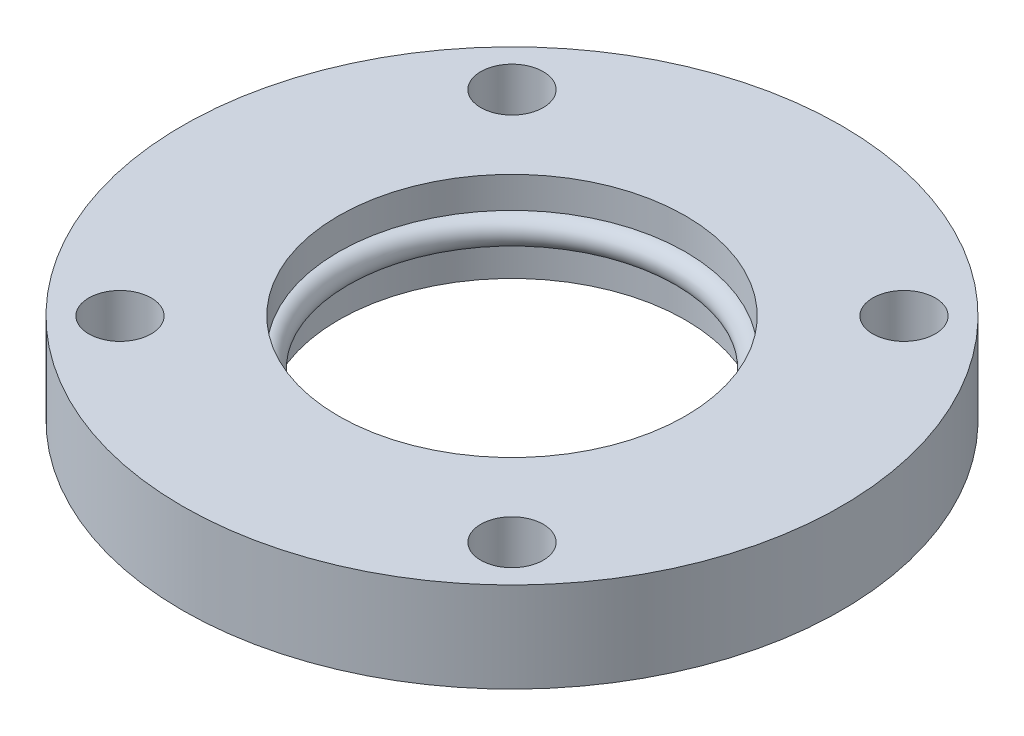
ISO-10303-21;
HEADER;
FILE_DESCRIPTION(('STEP AP214'),'2;1');
FILE_NAME('part.step','',(''),(''),'','','');
FILE_SCHEMA(('AUTOMOTIVE_DESIGN { 1 0 10303 214 1 1 1 1 }'));
ENDSEC;
DATA;
#1=APPLICATION_CONTEXT('core data for automotive mechanical design processes');
#2=APPLICATION_PROTOCOL_DEFINITION('international standard','automotive_design',2000,#1);
#3=PRODUCT_CONTEXT('',#1,'mechanical');
#4=PRODUCT('Part','Part','',(#3));
#5=PRODUCT_RELATED_PRODUCT_CATEGORY('part','',(#4));
#6=PRODUCT_DEFINITION_FORMATION('','',#4);
#7=PRODUCT_DEFINITION_CONTEXT('part definition',#1,'design');
#8=PRODUCT_DEFINITION('design','',#6,#7);
#9=PRODUCT_DEFINITION_SHAPE('','',#8);
#10=(LENGTH_UNIT() NAMED_UNIT(*) SI_UNIT(.MILLI.,.METRE.));
#11=(NAMED_UNIT(*) PLANE_ANGLE_UNIT() SI_UNIT($,.RADIAN.));
#12=(NAMED_UNIT(*) SI_UNIT($,.STERADIAN.) SOLID_ANGLE_UNIT());
#13=UNCERTAINTY_MEASURE_WITH_UNIT(LENGTH_MEASURE(1.E-05),#10,'distance_accuracy_value','');
#14=(GEOMETRIC_REPRESENTATION_CONTEXT(3) GLOBAL_UNCERTAINTY_ASSIGNED_CONTEXT((#13)) GLOBAL_UNIT_ASSIGNED_CONTEXT((#10,
#11,#12)) REPRESENTATION_CONTEXT('',''));
#15=CARTESIAN_POINT('',(0.,0.,0.));
#16=DIRECTION('',(0.,0.,1.));
#17=DIRECTION('',(1.,0.,0.));
#18=AXIS2_PLACEMENT_3D('',#15,#16,#17);
#19=CARTESIAN_POINT('',(0.,6.5,0.));
#20=DIRECTION('',(0.,-1.,0.));
#21=DIRECTION('',(0.,0.,-1.));
#22=AXIS2_PLACEMENT_3D('',#19,#20,#21);
#23=CYLINDRICAL_SURFACE('',#22,25.);
#24=CARTESIAN_POINT('',(0.,-6.5,0.));
#25=DIRECTION('',(0.,1.,0.));
#26=DIRECTION('',(0.,0.,1.));
#27=AXIS2_PLACEMENT_3D('',#24,#25,#26);
#28=CIRCLE('',#27,25.);
#29=CARTESIAN_POINT('',(0.,-6.5,-25.));
#30=VERTEX_POINT('',#29);
#31=EDGE_CURVE('E49',#30,#30,#28,.T.);
#32=CARTESIAN_POINT('',(0.,-2.,0.));
#33=DIRECTION('',(0.,1.,0.));
#34=DIRECTION('',(0.,0.,1.));
#35=AXIS2_PLACEMENT_3D('',#32,#33,#34);
#36=CIRCLE('',#35,25.);
#37=CARTESIAN_POINT('',(0.,-2.,-25.));
#38=VERTEX_POINT('',#37);
#39=EDGE_CURVE('E37',#38,#38,#36,.T.);
#40=CARTESIAN_POINT('',(0.,-6.5,-25.));
#41=CARTESIAN_POINT('',(0.,-6.453125,-25.));
#42=CARTESIAN_POINT('',(0.,-6.40625,-25.));
#43=CARTESIAN_POINT('',(0.,-6.3125,-25.));
#44=CARTESIAN_POINT('',(0.,-6.265625,-25.));
#45=CARTESIAN_POINT('',(0.,-6.171875,-25.));
#46=CARTESIAN_POINT('',(0.,-6.125,-25.));
#47=CARTESIAN_POINT('',(0.,-6.03125,-25.));
#48=CARTESIAN_POINT('',(0.,-5.984375,-25.));
#49=CARTESIAN_POINT('',(0.,-5.890625,-25.));
#50=CARTESIAN_POINT('',(0.,-5.84375,-25.));
#51=CARTESIAN_POINT('',(0.,-5.75,-25.));
#52=CARTESIAN_POINT('',(0.,-5.703125,-25.));
#53=CARTESIAN_POINT('',(0.,-5.609375,-25.));
#54=CARTESIAN_POINT('',(0.,-5.5625,-25.));
#55=CARTESIAN_POINT('',(0.,-5.46875,-25.));
#56=CARTESIAN_POINT('',(0.,-5.421875,-25.));
#57=CARTESIAN_POINT('',(0.,-5.328125,-25.));
#58=CARTESIAN_POINT('',(0.,-5.28125,-25.));
#59=CARTESIAN_POINT('',(0.,-5.1875,-25.));
#60=CARTESIAN_POINT('',(0.,-5.140625,-25.));
#61=CARTESIAN_POINT('',(0.,-5.046875,-25.));
#62=CARTESIAN_POINT('',(0.,-5.,-25.));
#63=CARTESIAN_POINT('',(0.,-4.90625,-25.));
#64=CARTESIAN_POINT('',(0.,-4.859375,-25.));
#65=CARTESIAN_POINT('',(0.,-4.765625,-25.));
#66=CARTESIAN_POINT('',(0.,-4.71875,-25.));
#67=CARTESIAN_POINT('',(0.,-4.625,-25.));
#68=CARTESIAN_POINT('',(0.,-4.578125,-25.));
#69=CARTESIAN_POINT('',(0.,-4.484375,-25.));
#70=CARTESIAN_POINT('',(0.,-4.4375,-25.));
#71=CARTESIAN_POINT('',(0.,-4.34375,-25.));
#72=CARTESIAN_POINT('',(0.,-4.296875,-25.));
#73=CARTESIAN_POINT('',(0.,-4.203125,-25.));
#74=CARTESIAN_POINT('',(0.,-4.15625,-25.));
#75=CARTESIAN_POINT('',(0.,-4.0625,-25.));
#76=CARTESIAN_POINT('',(0.,-4.015625,-25.));
#77=CARTESIAN_POINT('',(0.,-3.921875,-25.));
#78=CARTESIAN_POINT('',(0.,-3.875,-25.));
#79=CARTESIAN_POINT('',(0.,-3.78125,-25.));
#80=CARTESIAN_POINT('',(0.,-3.734375,-25.));
#81=CARTESIAN_POINT('',(0.,-3.640625,-25.));
#82=CARTESIAN_POINT('',(0.,-3.59375,-25.));
#83=CARTESIAN_POINT('',(0.,-3.5,-25.));
#84=CARTESIAN_POINT('',(0.,-3.453125,-25.));
#85=CARTESIAN_POINT('',(0.,-3.359375,-25.));
#86=CARTESIAN_POINT('',(0.,-3.3125,-25.));
#87=CARTESIAN_POINT('',(0.,-3.21875,-25.));
#88=CARTESIAN_POINT('',(0.,-3.171875,-25.));
#89=CARTESIAN_POINT('',(0.,-3.078125,-25.));
#90=CARTESIAN_POINT('',(0.,-3.03125,-25.));
#91=CARTESIAN_POINT('',(0.,-2.9375,-25.));
#92=CARTESIAN_POINT('',(0.,-2.890625,-25.));
#93=CARTESIAN_POINT('',(0.,-2.796875,-25.));
#94=CARTESIAN_POINT('',(0.,-2.75,-25.));
#95=CARTESIAN_POINT('',(0.,-2.65625,-25.));
#96=CARTESIAN_POINT('',(0.,-2.609375,-25.));
#97=CARTESIAN_POINT('',(0.,-2.515625,-25.));
#98=CARTESIAN_POINT('',(0.,-2.46875,-25.));
#99=CARTESIAN_POINT('',(0.,-2.375,-25.));
#100=CARTESIAN_POINT('',(0.,-2.328125,-25.));
#101=CARTESIAN_POINT('',(0.,-2.234375,-25.));
#102=CARTESIAN_POINT('',(0.,-2.1875,-25.));
#103=CARTESIAN_POINT('',(0.,-2.09375,-25.));
#104=CARTESIAN_POINT('',(0.,-2.046875,-25.));
#105=CARTESIAN_POINT('',(0.,-2.,-25.));
#106=B_SPLINE_CURVE_WITH_KNOTS('',3,(#40,#41,#42,#43,#44,#45,#46,#47,#48,#49,#50,#51,#52,#53,
#54,#55,#56,#57,#58,#59,#60,#61,#62,#63,#64,#65,#66,#67,#68,#69,#70,#71,#72,#73,#74,#75,#76,#77,
#78,#79,#80,#81,#82,#83,#84,#85,#86,#87,#88,#89,#90,#91,#92,#93,#94,#95,#96,#97,#98,#99,#100,
#101,#102,#103,#104,#105),.UNSPECIFIED.,.F.,.F.,(4,2,2,2,2,2,2,2,2,2,2,2,2,2,2,2,2,2,2,2,2,2,2,
2,2,2,2,2,2,2,2,2,4),(0.,0.140625,0.28125,0.421875,0.5625,0.703124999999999,0.843749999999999,
0.984374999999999,1.125,1.265625,1.40625,1.546875,1.6875,1.828125,1.96875,2.109375,2.25,
2.390625,2.53125,2.671875,2.8125,2.953125,3.09375,3.234375,3.375,3.515625,3.65625,3.796875,
3.9375,4.078125,4.21875,4.359375,4.5),.UNSPECIFIED.);
#107=EDGE_CURVE('BSEAM33',#30,#38,#106,.T.);
#108=ORIENTED_EDGE('',*,*,#31,.F.);
#109=ORIENTED_EDGE('',*,*,#39,.T.);
#110=ORIENTED_EDGE('',*,*,#107,.T.);
#111=ORIENTED_EDGE('',*,*,#107,.F.);
#112=EDGE_LOOP('',(#108,#110,#109,#111));
#113=FACE_BOUND('',#112,.T.);
#114=ADVANCED_FACE('F33',(#113),#23,.F.);
#115=CARTESIAN_POINT('',(0.,6.5,0.));
#116=DIRECTION('',(0.,1.,0.));
#117=DIRECTION('',(0.,0.,1.));
#118=AXIS2_PLACEMENT_3D('',#115,#116,#117);
#119=CIRCLE('',#118,25.);
#120=CARTESIAN_POINT('',(0.,6.5,-25.));
#121=VERTEX_POINT('',#120);
#122=EDGE_CURVE('E46',#121,#121,#119,.T.);
#123=CARTESIAN_POINT('',(0.,2.,0.));
#124=DIRECTION('',(0.,-1.,0.));
#125=DIRECTION('',(0.,0.,-1.));
#126=AXIS2_PLACEMENT_3D('',#123,#124,#125);
#127=CIRCLE('',#126,25.);
#128=CARTESIAN_POINT('',(0.,2.,-25.));
#129=VERTEX_POINT('',#128);
#130=EDGE_CURVE('E51',#129,#129,#127,.T.);
#131=CARTESIAN_POINT('',(0.,6.5,-25.));
#132=CARTESIAN_POINT('',(0.,6.453125,-25.));
#133=CARTESIAN_POINT('',(0.,6.40625,-25.));
#134=CARTESIAN_POINT('',(0.,6.3125,-25.));
#135=CARTESIAN_POINT('',(0.,6.265625,-25.));
#136=CARTESIAN_POINT('',(0.,6.171875,-25.));
#137=CARTESIAN_POINT('',(0.,6.125,-25.));
#138=CARTESIAN_POINT('',(0.,6.03125,-25.));
#139=CARTESIAN_POINT('',(0.,5.984375,-25.));
#140=CARTESIAN_POINT('',(0.,5.890625,-25.));
#141=CARTESIAN_POINT('',(0.,5.84375,-25.));
#142=CARTESIAN_POINT('',(0.,5.75,-25.));
#143=CARTESIAN_POINT('',(0.,5.703125,-25.));
#144=CARTESIAN_POINT('',(0.,5.609375,-25.));
#145=CARTESIAN_POINT('',(0.,5.5625,-25.));
#146=CARTESIAN_POINT('',(0.,5.46875,-25.));
#147=CARTESIAN_POINT('',(0.,5.421875,-25.));
#148=CARTESIAN_POINT('',(0.,5.328125,-25.));
#149=CARTESIAN_POINT('',(0.,5.28125,-25.));
#150=CARTESIAN_POINT('',(0.,5.1875,-25.));
#151=CARTESIAN_POINT('',(0.,5.140625,-25.));
#152=CARTESIAN_POINT('',(0.,5.046875,-25.));
#153=CARTESIAN_POINT('',(0.,5.,-25.));
#154=CARTESIAN_POINT('',(0.,4.90625,-25.));
#155=CARTESIAN_POINT('',(0.,4.859375,-25.));
#156=CARTESIAN_POINT('',(0.,4.765625,-25.));
#157=CARTESIAN_POINT('',(0.,4.71875,-25.));
#158=CARTESIAN_POINT('',(0.,4.625,-25.));
#159=CARTESIAN_POINT('',(0.,4.578125,-25.));
#160=CARTESIAN_POINT('',(0.,4.484375,-25.));
#161=CARTESIAN_POINT('',(0.,4.4375,-25.));
#162=CARTESIAN_POINT('',(0.,4.34375,-25.));
#163=CARTESIAN_POINT('',(0.,4.296875,-25.));
#164=CARTESIAN_POINT('',(0.,4.203125,-25.));
#165=CARTESIAN_POINT('',(0.,4.15625,-25.));
#166=CARTESIAN_POINT('',(0.,4.0625,-25.));
#167=CARTESIAN_POINT('',(0.,4.015625,-25.));
#168=CARTESIAN_POINT('',(0.,3.921875,-25.));
#169=CARTESIAN_POINT('',(0.,3.875,-25.));
#170=CARTESIAN_POINT('',(0.,3.78125,-25.));
#171=CARTESIAN_POINT('',(0.,3.734375,-25.));
#172=CARTESIAN_POINT('',(0.,3.640625,-25.));
#173=CARTESIAN_POINT('',(0.,3.59375,-25.));
#174=CARTESIAN_POINT('',(0.,3.5,-25.));
#175=CARTESIAN_POINT('',(0.,3.453125,-25.));
#176=CARTESIAN_POINT('',(0.,3.359375,-25.));
#177=CARTESIAN_POINT('',(0.,3.3125,-25.));
#178=CARTESIAN_POINT('',(0.,3.21875,-25.));
#179=CARTESIAN_POINT('',(0.,3.171875,-25.));
#180=CARTESIAN_POINT('',(0.,3.078125,-25.));
#181=CARTESIAN_POINT('',(0.,3.03125,-25.));
#182=CARTESIAN_POINT('',(0.,2.9375,-25.));
#183=CARTESIAN_POINT('',(0.,2.890625,-25.));
#184=CARTESIAN_POINT('',(0.,2.796875,-25.));
#185=CARTESIAN_POINT('',(0.,2.75,-25.));
#186=CARTESIAN_POINT('',(0.,2.65625,-25.));
#187=CARTESIAN_POINT('',(0.,2.609375,-25.));
#188=CARTESIAN_POINT('',(0.,2.515625,-25.));
#189=CARTESIAN_POINT('',(0.,2.46875,-25.));
#190=CARTESIAN_POINT('',(0.,2.375,-25.));
#191=CARTESIAN_POINT('',(0.,2.328125,-25.));
#192=CARTESIAN_POINT('',(0.,2.234375,-25.));
#193=CARTESIAN_POINT('',(0.,2.1875,-25.));
#194=CARTESIAN_POINT('',(0.,2.09375,-25.));
#195=CARTESIAN_POINT('',(0.,2.046875,-25.));
#196=CARTESIAN_POINT('',(0.,2.,-25.));
#197=B_SPLINE_CURVE_WITH_KNOTS('',3,(#131,#132,#133,#134,#135,#136,#137,#138,#139,#140,#141,
#142,#143,#144,#145,#146,#147,#148,#149,#150,#151,#152,#153,#154,#155,#156,#157,#158,#159,#160,
#161,#162,#163,#164,#165,#166,#167,#168,#169,#170,#171,#172,#173,#174,#175,#176,#177,#178,#179,
#180,#181,#182,#183,#184,#185,#186,#187,#188,#189,#190,#191,#192,#193,#194,#195,#196),
.UNSPECIFIED.,.F.,.F.,(4,2,2,2,2,2,2,2,2,2,2,2,2,2,2,2,2,2,2,2,2,2,2,2,2,2,2,2,2,2,2,2,4),(0.,
0.140624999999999,0.281249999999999,0.421875,0.562499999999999,0.703124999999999,
0.843749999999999,0.984374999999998,1.125,1.265625,1.40625,1.546875,1.6875,1.828125,1.96875,
2.109375,2.25,2.390625,2.53125,2.671875,2.8125,2.953125,3.09375,3.234375,3.375,3.515625,3.65625,
3.796875,3.9375,4.078125,4.21875,4.359375,4.5),.UNSPECIFIED.);
#198=EDGE_CURVE('BSEAM94',#121,#129,#197,.T.);
#199=ORIENTED_EDGE('',*,*,#122,.T.);
#200=ORIENTED_EDGE('',*,*,#130,.T.);
#201=ORIENTED_EDGE('',*,*,#198,.T.);
#202=ORIENTED_EDGE('',*,*,#198,.F.);
#203=EDGE_LOOP('',(#199,#201,#200,#202));
#204=FACE_BOUND('',#203,.T.);
#205=ADVANCED_FACE('F94',(#204),#23,.F.);
#206=CARTESIAN_POINT('',(0.,6.5,0.));
#207=DIRECTION('',(0.,1.,0.));
#208=DIRECTION('',(0.,0.,1.));
#209=AXIS2_PLACEMENT_3D('',#206,#207,#208);
#210=PLANE('',#209);
#211=CARTESIAN_POINT('',(28.25,6.5,28.25));
#212=DIRECTION('',(0.,1.,0.));
#213=DIRECTION('',(0.,0.,1.));
#214=AXIS2_PLACEMENT_3D('',#211,#212,#213);
#215=CIRCLE('',#214,4.5);
#216=CARTESIAN_POINT('',(28.25,6.5,23.75));
#217=VERTEX_POINT('',#216);
#218=EDGE_CURVE('E68',#217,#217,#215,.T.);
#219=ORIENTED_EDGE('',*,*,#218,.F.);
#220=EDGE_LOOP('',(#219));
#221=FACE_BOUND('',#220,.T.);
#222=CARTESIAN_POINT('',(-28.25,6.5,-28.25));
#223=DIRECTION('',(0.,1.,0.));
#224=DIRECTION('',(0.,0.,1.));
#225=AXIS2_PLACEMENT_3D('',#222,#223,#224);
#226=CIRCLE('',#225,4.5);
#227=CARTESIAN_POINT('',(-28.25,6.5,-32.75));
#228=VERTEX_POINT('',#227);
#229=EDGE_CURVE('E80',#228,#228,#226,.T.);
#230=ORIENTED_EDGE('',*,*,#229,.F.);
#231=EDGE_LOOP('',(#230));
#232=FACE_BOUND('',#231,.T.);
#233=CARTESIAN_POINT('',(0.,6.5,0.));
#234=DIRECTION('',(0.,1.,0.));
#235=DIRECTION('',(0.,0.,1.));
#236=AXIS2_PLACEMENT_3D('',#233,#234,#235);
#237=CIRCLE('',#236,47.5);
#238=CARTESIAN_POINT('',(0.,6.5,-47.5));
#239=VERTEX_POINT('',#238);
#240=EDGE_CURVE('E10',#239,#239,#237,.T.);
#241=ORIENTED_EDGE('',*,*,#240,.T.);
#242=EDGE_LOOP('',(#241));
#243=FACE_BOUND('',#242,.T.);
#244=ORIENTED_EDGE('',*,*,#122,.F.);
#245=EDGE_LOOP('',(#244));
#246=FACE_BOUND('',#245,.T.);
#247=CARTESIAN_POINT('',(28.25,6.5,-28.25));
#248=DIRECTION('',(0.,1.,0.));
#249=DIRECTION('',(0.,0.,1.));
#250=AXIS2_PLACEMENT_3D('',#247,#248,#249);
#251=CIRCLE('',#250,4.5);
#252=CARTESIAN_POINT('',(28.25,6.5,-32.75));
#253=VERTEX_POINT('',#252);
#254=EDGE_CURVE('E74',#253,#253,#251,.T.);
#255=ORIENTED_EDGE('',*,*,#254,.F.);
#256=EDGE_LOOP('',(#255));
#257=FACE_BOUND('',#256,.T.);
#258=CARTESIAN_POINT('',(-28.25,6.5,28.25));
#259=DIRECTION('',(0.,1.,0.));
#260=DIRECTION('',(0.,0.,1.));
#261=AXIS2_PLACEMENT_3D('',#258,#259,#260);
#262=CIRCLE('',#261,4.5);
#263=CARTESIAN_POINT('',(-28.25,6.5,23.75));
#264=VERTEX_POINT('',#263);
#265=EDGE_CURVE('E60',#264,#264,#262,.T.);
#266=ORIENTED_EDGE('',*,*,#265,.F.);
#267=EDGE_LOOP('',(#266));
#268=FACE_BOUND('',#267,.T.);
#269=ADVANCED_FACE('F99',(#221,#232,#243,#246,#257,#268),#210,.T.);
#270=CARTESIAN_POINT('',(0.,-6.5,0.));
#271=DIRECTION('',(0.,1.,0.));
#272=DIRECTION('',(0.,0.,1.));
#273=AXIS2_PLACEMENT_3D('',#270,#271,#272);
#274=PLANE('',#273);
#275=CARTESIAN_POINT('',(0.,-6.5,0.));
#276=DIRECTION('',(0.,1.,0.));
#277=DIRECTION('',(0.,0.,1.));
#278=AXIS2_PLACEMENT_3D('',#275,#276,#277);
#279=CIRCLE('',#278,47.5);
#280=CARTESIAN_POINT('',(0.,-6.5,-47.5));
#281=VERTEX_POINT('',#280);
#282=EDGE_CURVE('E41',#281,#281,#279,.T.);
#283=ORIENTED_EDGE('',*,*,#282,.F.);
#284=EDGE_LOOP('',(#283));
#285=FACE_BOUND('',#284,.T.);
#286=ORIENTED_EDGE('',*,*,#31,.T.);
#287=EDGE_LOOP('',(#286));
#288=FACE_BOUND('',#287,.T.);
#289=CARTESIAN_POINT('',(-28.25,-6.5,-28.25));
#290=DIRECTION('',(0.,1.,0.));
#291=DIRECTION('',(0.,0.,1.));
#292=AXIS2_PLACEMENT_3D('',#289,#290,#291);
#293=CIRCLE('',#292,4.5);
#294=CARTESIAN_POINT('',(-28.25,-6.5,-32.75));
#295=VERTEX_POINT('',#294);
#296=EDGE_CURVE('E77',#295,#295,#293,.T.);
#297=ORIENTED_EDGE('',*,*,#296,.T.);
#298=EDGE_LOOP('',(#297));
#299=FACE_BOUND('',#298,.T.);
#300=CARTESIAN_POINT('',(28.25,-6.5,-28.25));
#301=DIRECTION('',(0.,1.,0.));
#302=DIRECTION('',(0.,0.,1.));
#303=AXIS2_PLACEMENT_3D('',#300,#301,#302);
#304=CIRCLE('',#303,4.5);
#305=CARTESIAN_POINT('',(28.25,-6.5,-32.75));
#306=VERTEX_POINT('',#305);
#307=EDGE_CURVE('E71',#306,#306,#304,.T.);
#308=ORIENTED_EDGE('',*,*,#307,.T.);
#309=EDGE_LOOP('',(#308));
#310=FACE_BOUND('',#309,.T.);
#311=CARTESIAN_POINT('',(28.25,-6.5,28.25));
#312=DIRECTION('',(0.,1.,0.));
#313=DIRECTION('',(0.,0.,1.));
#314=AXIS2_PLACEMENT_3D('',#311,#312,#313);
#315=CIRCLE('',#314,4.5);
#316=CARTESIAN_POINT('',(28.25,-6.5,23.75));
#317=VERTEX_POINT('',#316);
#318=EDGE_CURVE('E65',#317,#317,#315,.T.);
#319=ORIENTED_EDGE('',*,*,#318,.T.);
#320=EDGE_LOOP('',(#319));
#321=FACE_BOUND('',#320,.T.);
#322=CARTESIAN_POINT('',(-28.25,-6.5,28.25));
#323=DIRECTION('',(0.,1.,0.));
#324=DIRECTION('',(0.,0.,1.));
#325=AXIS2_PLACEMENT_3D('',#322,#323,#324);
#326=CIRCLE('',#325,4.5);
#327=CARTESIAN_POINT('',(-28.25,-6.5,23.75));
#328=VERTEX_POINT('',#327);
#329=EDGE_CURVE('E56',#328,#328,#326,.T.);
#330=ORIENTED_EDGE('',*,*,#329,.T.);
#331=EDGE_LOOP('',(#330));
#332=FACE_BOUND('',#331,.T.);
#333=ADVANCED_FACE('F90',(#285,#288,#299,#310,#321,#332),#274,.F.);
#334=CARTESIAN_POINT('',(0.,6.5,0.));
#335=DIRECTION('',(0.,-1.,0.));
#336=DIRECTION('',(0.,0.,-1.));
#337=AXIS2_PLACEMENT_3D('',#334,#335,#336);
#338=CYLINDRICAL_SURFACE('',#337,47.5);
#339=CARTESIAN_POINT('',(0.,6.5,-47.5));
#340=CARTESIAN_POINT('',(0.,6.36458333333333,-47.5));
#341=CARTESIAN_POINT('',(0.,6.22916666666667,-47.5));
#342=CARTESIAN_POINT('',(0.,5.95833333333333,-47.5));
#343=CARTESIAN_POINT('',(0.,5.82291666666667,-47.5));
#344=CARTESIAN_POINT('',(0.,5.55208333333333,-47.5));
#345=CARTESIAN_POINT('',(0.,5.41666666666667,-47.5));
#346=CARTESIAN_POINT('',(0.,5.14583333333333,-47.5));
#347=CARTESIAN_POINT('',(0.,5.01041666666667,-47.5));
#348=CARTESIAN_POINT('',(0.,4.73958333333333,-47.5));
#349=CARTESIAN_POINT('',(0.,4.60416666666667,-47.5));
#350=CARTESIAN_POINT('',(0.,4.33333333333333,-47.5));
#351=CARTESIAN_POINT('',(0.,4.19791666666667,-47.5));
#352=CARTESIAN_POINT('',(0.,3.92708333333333,-47.5));
#353=CARTESIAN_POINT('',(0.,3.79166666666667,-47.5));
#354=CARTESIAN_POINT('',(0.,3.52083333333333,-47.5));
#355=CARTESIAN_POINT('',(0.,3.38541666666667,-47.5));
#356=CARTESIAN_POINT('',(0.,3.11458333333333,-47.5));
#357=CARTESIAN_POINT('',(0.,2.97916666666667,-47.5));
#358=CARTESIAN_POINT('',(0.,2.70833333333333,-47.5));
#359=CARTESIAN_POINT('',(0.,2.57291666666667,-47.5));
#360=CARTESIAN_POINT('',(0.,2.30208333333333,-47.5));
#361=CARTESIAN_POINT('',(0.,2.16666666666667,-47.5));
#362=CARTESIAN_POINT('',(0.,1.89583333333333,-47.5));
#363=CARTESIAN_POINT('',(0.,1.76041666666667,-47.5));
#364=CARTESIAN_POINT('',(0.,1.48958333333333,-47.5));
#365=CARTESIAN_POINT('',(0.,1.35416666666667,-47.5));
#366=CARTESIAN_POINT('',(0.,1.08333333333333,-47.5));
#367=CARTESIAN_POINT('',(0.,0.947916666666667,-47.5));
#368=CARTESIAN_POINT('',(0.,0.677083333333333,-47.5));
#369=CARTESIAN_POINT('',(0.,0.541666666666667,-47.5));
#370=CARTESIAN_POINT('',(0.,0.270833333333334,-47.5));
#371=CARTESIAN_POINT('',(0.,0.135416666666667,-47.5));
#372=CARTESIAN_POINT('',(0.,-0.135416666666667,-47.5));
#373=CARTESIAN_POINT('',(0.,-0.270833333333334,-47.5));
#374=CARTESIAN_POINT('',(0.,-0.541666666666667,-47.5));
#375=CARTESIAN_POINT('',(0.,-0.677083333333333,-47.5));
#376=CARTESIAN_POINT('',(0.,-0.947916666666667,-47.5));
#377=CARTESIAN_POINT('',(0.,-1.08333333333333,-47.5));
#378=CARTESIAN_POINT('',(0.,-1.35416666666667,-47.5));
#379=CARTESIAN_POINT('',(0.,-1.48958333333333,-47.5));
#380=CARTESIAN_POINT('',(0.,-1.76041666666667,-47.5));
#381=CARTESIAN_POINT('',(0.,-1.89583333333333,-47.5));
#382=CARTESIAN_POINT('',(0.,-2.16666666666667,-47.5));
#383=CARTESIAN_POINT('',(0.,-2.30208333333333,-47.5));
#384=CARTESIAN_POINT('',(0.,-2.57291666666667,-47.5));
#385=CARTESIAN_POINT('',(0.,-2.70833333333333,-47.5));
#386=CARTESIAN_POINT('',(0.,-2.97916666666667,-47.5));
#387=CARTESIAN_POINT('',(0.,-3.11458333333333,-47.5));
#388=CARTESIAN_POINT('',(0.,-3.38541666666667,-47.5));
#389=CARTESIAN_POINT('',(0.,-3.52083333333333,-47.5));
#390=CARTESIAN_POINT('',(0.,-3.79166666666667,-47.5));
#391=CARTESIAN_POINT('',(0.,-3.92708333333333,-47.5));
#392=CARTESIAN_POINT('',(0.,-4.19791666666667,-47.5));
#393=CARTESIAN_POINT('',(0.,-4.33333333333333,-47.5));
#394=CARTESIAN_POINT('',(0.,-4.60416666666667,-47.5));
#395=CARTESIAN_POINT('',(0.,-4.73958333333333,-47.5));
#396=CARTESIAN_POINT('',(0.,-5.01041666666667,-47.5));
#397=CARTESIAN_POINT('',(0.,-5.14583333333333,-47.5));
#398=CARTESIAN_POINT('',(0.,-5.41666666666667,-47.5));
#399=CARTESIAN_POINT('',(0.,-5.55208333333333,-47.5));
#400=CARTESIAN_POINT('',(0.,-5.82291666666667,-47.5));
#401=CARTESIAN_POINT('',(0.,-5.95833333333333,-47.5));
#402=CARTESIAN_POINT('',(0.,-6.22916666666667,-47.5));
#403=CARTESIAN_POINT('',(0.,-6.36458333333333,-47.5));
#404=CARTESIAN_POINT('',(0.,-6.5,-47.5));
#405=B_SPLINE_CURVE_WITH_KNOTS('',3,(#339,#340,#341,#342,#343,#344,#345,#346,#347,#348,#349,
#350,#351,#352,#353,#354,#355,#356,#357,#358,#359,#360,#361,#362,#363,#364,#365,#366,#367,#368,
#369,#370,#371,#372,#373,#374,#375,#376,#377,#378,#379,#380,#381,#382,#383,#384,#385,#386,#387,
#388,#389,#390,#391,#392,#393,#394,#395,#396,#397,#398,#399,#400,#401,#402,#403,#404),
.UNSPECIFIED.,.F.,.F.,(4,2,2,2,2,2,2,2,2,2,2,2,2,2,2,2,2,2,2,2,2,2,2,2,2,2,2,2,2,2,2,2,4),(0.,
0.40625,0.812500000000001,1.21875,1.625,2.03125,2.4375,2.84375,3.25,3.65625,4.0625,4.46875,
4.875,5.28125,5.6875,6.09375,6.5,6.90625,7.3125,7.71875,8.125,8.53125,8.9375,9.34375,9.75,
10.15625,10.5625,10.96875,11.375,11.78125,12.1875,12.59375,13.),.UNSPECIFIED.);
#406=EDGE_CURVE('BSEAM35',#239,#281,#405,.T.);
#407=ORIENTED_EDGE('',*,*,#240,.F.);
#408=ORIENTED_EDGE('',*,*,#282,.T.);
#409=ORIENTED_EDGE('',*,*,#406,.T.);
#410=ORIENTED_EDGE('',*,*,#406,.F.);
#411=EDGE_LOOP('',(#407,#409,#408,#410));
#412=FACE_BOUND('',#411,.T.);
#413=ADVANCED_FACE('F35',(#412),#338,.T.);
#414=CARTESIAN_POINT('',(-28.25,6.5,-28.25));
#415=DIRECTION('',(0.,-1.,0.));
#416=DIRECTION('',(0.,0.,-1.));
#417=AXIS2_PLACEMENT_3D('',#414,#415,#416);
#418=CYLINDRICAL_SURFACE('',#417,4.5);
#419=CARTESIAN_POINT('',(-28.25,6.5,-32.75));
#420=CARTESIAN_POINT('',(-28.25,6.36458333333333,-32.75));
#421=CARTESIAN_POINT('',(-28.25,6.22916666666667,-32.75));
#422=CARTESIAN_POINT('',(-28.25,5.95833333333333,-32.75));
#423=CARTESIAN_POINT('',(-28.25,5.82291666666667,-32.75));
#424=CARTESIAN_POINT('',(-28.25,5.55208333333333,-32.75));
#425=CARTESIAN_POINT('',(-28.25,5.41666666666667,-32.75));
#426=CARTESIAN_POINT('',(-28.25,5.14583333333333,-32.75));
#427=CARTESIAN_POINT('',(-28.25,5.01041666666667,-32.75));
#428=CARTESIAN_POINT('',(-28.25,4.73958333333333,-32.75));
#429=CARTESIAN_POINT('',(-28.25,4.60416666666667,-32.75));
#430=CARTESIAN_POINT('',(-28.25,4.33333333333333,-32.75));
#431=CARTESIAN_POINT('',(-28.25,4.19791666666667,-32.75));
#432=CARTESIAN_POINT('',(-28.25,3.92708333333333,-32.75));
#433=CARTESIAN_POINT('',(-28.25,3.79166666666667,-32.75));
#434=CARTESIAN_POINT('',(-28.25,3.52083333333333,-32.75));
#435=CARTESIAN_POINT('',(-28.25,3.38541666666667,-32.75));
#436=CARTESIAN_POINT('',(-28.25,3.11458333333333,-32.75));
#437=CARTESIAN_POINT('',(-28.25,2.97916666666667,-32.75));
#438=CARTESIAN_POINT('',(-28.25,2.70833333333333,-32.75));
#439=CARTESIAN_POINT('',(-28.25,2.57291666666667,-32.75));
#440=CARTESIAN_POINT('',(-28.25,2.30208333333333,-32.75));
#441=CARTESIAN_POINT('',(-28.25,2.16666666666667,-32.75));
#442=CARTESIAN_POINT('',(-28.25,1.89583333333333,-32.75));
#443=CARTESIAN_POINT('',(-28.25,1.76041666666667,-32.75));
#444=CARTESIAN_POINT('',(-28.25,1.48958333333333,-32.75));
#445=CARTESIAN_POINT('',(-28.25,1.35416666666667,-32.75));
#446=CARTESIAN_POINT('',(-28.25,1.08333333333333,-32.75));
#447=CARTESIAN_POINT('',(-28.25,0.947916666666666,-32.75));
#448=CARTESIAN_POINT('',(-28.25,0.677083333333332,-32.75));
#449=CARTESIAN_POINT('',(-28.25,0.541666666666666,-32.75));
#450=CARTESIAN_POINT('',(-28.25,0.270833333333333,-32.75));
#451=CARTESIAN_POINT('',(-28.25,0.135416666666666,-32.75));
#452=CARTESIAN_POINT('',(-28.25,-0.135416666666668,-32.75));
#453=CARTESIAN_POINT('',(-28.25,-0.270833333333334,-32.75));
#454=CARTESIAN_POINT('',(-28.25,-0.541666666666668,-32.75));
#455=CARTESIAN_POINT('',(-28.25,-0.677083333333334,-32.75));
#456=CARTESIAN_POINT('',(-28.25,-0.947916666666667,-32.75));
#457=CARTESIAN_POINT('',(-28.25,-1.08333333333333,-32.75));
#458=CARTESIAN_POINT('',(-28.25,-1.35416666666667,-32.75));
#459=CARTESIAN_POINT('',(-28.25,-1.48958333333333,-32.75));
#460=CARTESIAN_POINT('',(-28.25,-1.76041666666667,-32.75));
#461=CARTESIAN_POINT('',(-28.25,-1.89583333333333,-32.75));
#462=CARTESIAN_POINT('',(-28.25,-2.16666666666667,-32.75));
#463=CARTESIAN_POINT('',(-28.25,-2.30208333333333,-32.75));
#464=CARTESIAN_POINT('',(-28.25,-2.57291666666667,-32.75));
#465=CARTESIAN_POINT('',(-28.25,-2.70833333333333,-32.75));
#466=CARTESIAN_POINT('',(-28.25,-2.97916666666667,-32.75));
#467=CARTESIAN_POINT('',(-28.25,-3.11458333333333,-32.75));
#468=CARTESIAN_POINT('',(-28.25,-3.38541666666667,-32.75));
#469=CARTESIAN_POINT('',(-28.25,-3.52083333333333,-32.75));
#470=CARTESIAN_POINT('',(-28.25,-3.79166666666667,-32.75));
#471=CARTESIAN_POINT('',(-28.25,-3.92708333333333,-32.75));
#472=CARTESIAN_POINT('',(-28.25,-4.19791666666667,-32.75));
#473=CARTESIAN_POINT('',(-28.25,-4.33333333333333,-32.75));
#474=CARTESIAN_POINT('',(-28.25,-4.60416666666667,-32.75));
#475=CARTESIAN_POINT('',(-28.25,-4.73958333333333,-32.75));
#476=CARTESIAN_POINT('',(-28.25,-5.01041666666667,-32.75));
#477=CARTESIAN_POINT('',(-28.25,-5.14583333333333,-32.75));
#478=CARTESIAN_POINT('',(-28.25,-5.41666666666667,-32.75));
#479=CARTESIAN_POINT('',(-28.25,-5.55208333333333,-32.75));
#480=CARTESIAN_POINT('',(-28.25,-5.82291666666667,-32.75));
#481=CARTESIAN_POINT('',(-28.25,-5.95833333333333,-32.75));
#482=CARTESIAN_POINT('',(-28.25,-6.22916666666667,-32.75));
#483=CARTESIAN_POINT('',(-28.25,-6.36458333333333,-32.75));
#484=CARTESIAN_POINT('',(-28.25,-6.5,-32.75));
#485=B_SPLINE_CURVE_WITH_KNOTS('',3,(#419,#420,#421,#422,#423,#424,#425,#426,#427,#428,#429,
#430,#431,#432,#433,#434,#435,#436,#437,#438,#439,#440,#441,#442,#443,#444,#445,#446,#447,#448,
#449,#450,#451,#452,#453,#454,#455,#456,#457,#458,#459,#460,#461,#462,#463,#464,#465,#466,#467,
#468,#469,#470,#471,#472,#473,#474,#475,#476,#477,#478,#479,#480,#481,#482,#483,#484),
.UNSPECIFIED.,.F.,.F.,(4,2,2,2,2,2,2,2,2,2,2,2,2,2,2,2,2,2,2,2,2,2,2,2,2,2,2,2,2,2,2,2,4),(0.,
0.40625,0.8125,1.21875,1.625,2.03125,2.4375,2.84375,3.25,3.65625,4.0625,4.46875,4.875,5.28125,
5.6875,6.09375,6.5,6.90625,7.3125,7.71875,8.125,8.53125,8.9375,9.34375,9.75,10.15625,10.5625,
10.96875,11.375,11.78125,12.1875,12.59375,13.),.UNSPECIFIED.);
#486=EDGE_CURVE('BSEAM102',#228,#295,#485,.T.);
#487=ORIENTED_EDGE('',*,*,#229,.T.);
#488=ORIENTED_EDGE('',*,*,#296,.F.);
#489=ORIENTED_EDGE('',*,*,#486,.T.);
#490=ORIENTED_EDGE('',*,*,#486,.F.);
#491=EDGE_LOOP('',(#487,#489,#488,#490));
#492=FACE_BOUND('',#491,.T.);
#493=ADVANCED_FACE('F102',(#492),#418,.F.);
#494=CARTESIAN_POINT('',(28.25,6.5,-28.25));
#495=DIRECTION('',(0.,-1.,0.));
#496=DIRECTION('',(0.,0.,-1.));
#497=AXIS2_PLACEMENT_3D('',#494,#495,#496);
#498=CYLINDRICAL_SURFACE('',#497,4.5);
#499=CARTESIAN_POINT('',(28.25,6.5,-32.75));
#500=CARTESIAN_POINT('',(28.25,6.36458333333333,-32.75));
#501=CARTESIAN_POINT('',(28.25,6.22916666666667,-32.75));
#502=CARTESIAN_POINT('',(28.25,5.95833333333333,-32.75));
#503=CARTESIAN_POINT('',(28.25,5.82291666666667,-32.75));
#504=CARTESIAN_POINT('',(28.25,5.55208333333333,-32.75));
#505=CARTESIAN_POINT('',(28.25,5.41666666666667,-32.75));
#506=CARTESIAN_POINT('',(28.25,5.14583333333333,-32.75));
#507=CARTESIAN_POINT('',(28.25,5.01041666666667,-32.75));
#508=CARTESIAN_POINT('',(28.25,4.73958333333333,-32.75));
#509=CARTESIAN_POINT('',(28.25,4.60416666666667,-32.75));
#510=CARTESIAN_POINT('',(28.25,4.33333333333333,-32.75));
#511=CARTESIAN_POINT('',(28.25,4.19791666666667,-32.75));
#512=CARTESIAN_POINT('',(28.25,3.92708333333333,-32.75));
#513=CARTESIAN_POINT('',(28.25,3.79166666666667,-32.75));
#514=CARTESIAN_POINT('',(28.25,3.52083333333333,-32.75));
#515=CARTESIAN_POINT('',(28.25,3.38541666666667,-32.75));
#516=CARTESIAN_POINT('',(28.25,3.11458333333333,-32.75));
#517=CARTESIAN_POINT('',(28.25,2.97916666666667,-32.75));
#518=CARTESIAN_POINT('',(28.25,2.70833333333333,-32.75));
#519=CARTESIAN_POINT('',(28.25,2.57291666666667,-32.75));
#520=CARTESIAN_POINT('',(28.25,2.30208333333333,-32.75));
#521=CARTESIAN_POINT('',(28.25,2.16666666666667,-32.75));
#522=CARTESIAN_POINT('',(28.25,1.89583333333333,-32.75));
#523=CARTESIAN_POINT('',(28.25,1.76041666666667,-32.75));
#524=CARTESIAN_POINT('',(28.25,1.48958333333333,-32.75));
#525=CARTESIAN_POINT('',(28.25,1.35416666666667,-32.75));
#526=CARTESIAN_POINT('',(28.25,1.08333333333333,-32.75));
#527=CARTESIAN_POINT('',(28.25,0.947916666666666,-32.75));
#528=CARTESIAN_POINT('',(28.25,0.677083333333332,-32.75));
#529=CARTESIAN_POINT('',(28.25,0.541666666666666,-32.75));
#530=CARTESIAN_POINT('',(28.25,0.270833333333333,-32.75));
#531=CARTESIAN_POINT('',(28.25,0.135416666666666,-32.75));
#532=CARTESIAN_POINT('',(28.25,-0.135416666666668,-32.75));
#533=CARTESIAN_POINT('',(28.25,-0.270833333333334,-32.75));
#534=CARTESIAN_POINT('',(28.25,-0.541666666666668,-32.75));
#535=CARTESIAN_POINT('',(28.25,-0.677083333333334,-32.75));
#536=CARTESIAN_POINT('',(28.25,-0.947916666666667,-32.75));
#537=CARTESIAN_POINT('',(28.25,-1.08333333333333,-32.75));
#538=CARTESIAN_POINT('',(28.25,-1.35416666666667,-32.75));
#539=CARTESIAN_POINT('',(28.25,-1.48958333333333,-32.75));
#540=CARTESIAN_POINT('',(28.25,-1.76041666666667,-32.75));
#541=CARTESIAN_POINT('',(28.25,-1.89583333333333,-32.75));
#542=CARTESIAN_POINT('',(28.25,-2.16666666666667,-32.75));
#543=CARTESIAN_POINT('',(28.25,-2.30208333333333,-32.75));
#544=CARTESIAN_POINT('',(28.25,-2.57291666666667,-32.75));
#545=CARTESIAN_POINT('',(28.25,-2.70833333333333,-32.75));
#546=CARTESIAN_POINT('',(28.25,-2.97916666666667,-32.75));
#547=CARTESIAN_POINT('',(28.25,-3.11458333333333,-32.75));
#548=CARTESIAN_POINT('',(28.25,-3.38541666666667,-32.75));
#549=CARTESIAN_POINT('',(28.25,-3.52083333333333,-32.75));
#550=CARTESIAN_POINT('',(28.25,-3.79166666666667,-32.75));
#551=CARTESIAN_POINT('',(28.25,-3.92708333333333,-32.75));
#552=CARTESIAN_POINT('',(28.25,-4.19791666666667,-32.75));
#553=CARTESIAN_POINT('',(28.25,-4.33333333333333,-32.75));
#554=CARTESIAN_POINT('',(28.25,-4.60416666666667,-32.75));
#555=CARTESIAN_POINT('',(28.25,-4.73958333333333,-32.75));
#556=CARTESIAN_POINT('',(28.25,-5.01041666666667,-32.75));
#557=CARTESIAN_POINT('',(28.25,-5.14583333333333,-32.75));
#558=CARTESIAN_POINT('',(28.25,-5.41666666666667,-32.75));
#559=CARTESIAN_POINT('',(28.25,-5.55208333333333,-32.75));
#560=CARTESIAN_POINT('',(28.25,-5.82291666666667,-32.75));
#561=CARTESIAN_POINT('',(28.25,-5.95833333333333,-32.75));
#562=CARTESIAN_POINT('',(28.25,-6.22916666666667,-32.75));
#563=CARTESIAN_POINT('',(28.25,-6.36458333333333,-32.75));
#564=CARTESIAN_POINT('',(28.25,-6.5,-32.75));
#565=B_SPLINE_CURVE_WITH_KNOTS('',3,(#499,#500,#501,#502,#503,#504,#505,#506,#507,#508,#509,
#510,#511,#512,#513,#514,#515,#516,#517,#518,#519,#520,#521,#522,#523,#524,#525,#526,#527,#528,
#529,#530,#531,#532,#533,#534,#535,#536,#537,#538,#539,#540,#541,#542,#543,#544,#545,#546,#547,
#548,#549,#550,#551,#552,#553,#554,#555,#556,#557,#558,#559,#560,#561,#562,#563,#564),
.UNSPECIFIED.,.F.,.F.,(4,2,2,2,2,2,2,2,2,2,2,2,2,2,2,2,2,2,2,2,2,2,2,2,2,2,2,2,2,2,2,2,4),(0.,
0.40625,0.8125,1.21875,1.625,2.03125,2.4375,2.84375,3.25,3.65625,4.0625,4.46875,4.875,5.28125,
5.6875,6.09375,6.5,6.90625,7.3125,7.71875,8.125,8.53125,8.9375,9.34375,9.75,10.15625,10.5625,
10.96875,11.375,11.78125,12.1875,12.59375,13.),.UNSPECIFIED.);
#566=EDGE_CURVE('BSEAM117',#253,#306,#565,.T.);
#567=ORIENTED_EDGE('',*,*,#254,.T.);
#568=ORIENTED_EDGE('',*,*,#307,.F.);
#569=ORIENTED_EDGE('',*,*,#566,.T.);
#570=ORIENTED_EDGE('',*,*,#566,.F.);
#571=EDGE_LOOP('',(#567,#569,#568,#570));
#572=FACE_BOUND('',#571,.T.);
#573=ADVANCED_FACE('F117',(#572),#498,.F.);
#574=CARTESIAN_POINT('',(28.25,6.5,28.25));
#575=DIRECTION('',(0.,-1.,0.));
#576=DIRECTION('',(0.,0.,-1.));
#577=AXIS2_PLACEMENT_3D('',#574,#575,#576);
#578=CYLINDRICAL_SURFACE('',#577,4.5);
#579=CARTESIAN_POINT('',(28.25,6.5,23.75));
#580=CARTESIAN_POINT('',(28.25,6.36458333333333,23.75));
#581=CARTESIAN_POINT('',(28.25,6.22916666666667,23.75));
#582=CARTESIAN_POINT('',(28.25,5.95833333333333,23.75));
#583=CARTESIAN_POINT('',(28.25,5.82291666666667,23.75));
#584=CARTESIAN_POINT('',(28.25,5.55208333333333,23.75));
#585=CARTESIAN_POINT('',(28.25,5.41666666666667,23.75));
#586=CARTESIAN_POINT('',(28.25,5.14583333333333,23.75));
#587=CARTESIAN_POINT('',(28.25,5.01041666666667,23.75));
#588=CARTESIAN_POINT('',(28.25,4.73958333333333,23.75));
#589=CARTESIAN_POINT('',(28.25,4.60416666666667,23.75));
#590=CARTESIAN_POINT('',(28.25,4.33333333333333,23.75));
#591=CARTESIAN_POINT('',(28.25,4.19791666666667,23.75));
#592=CARTESIAN_POINT('',(28.25,3.92708333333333,23.75));
#593=CARTESIAN_POINT('',(28.25,3.79166666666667,23.75));
#594=CARTESIAN_POINT('',(28.25,3.52083333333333,23.75));
#595=CARTESIAN_POINT('',(28.25,3.38541666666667,23.75));
#596=CARTESIAN_POINT('',(28.25,3.11458333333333,23.75));
#597=CARTESIAN_POINT('',(28.25,2.97916666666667,23.75));
#598=CARTESIAN_POINT('',(28.25,2.70833333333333,23.75));
#599=CARTESIAN_POINT('',(28.25,2.57291666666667,23.75));
#600=CARTESIAN_POINT('',(28.25,2.30208333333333,23.75));
#601=CARTESIAN_POINT('',(28.25,2.16666666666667,23.75));
#602=CARTESIAN_POINT('',(28.25,1.89583333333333,23.75));
#603=CARTESIAN_POINT('',(28.25,1.76041666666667,23.75));
#604=CARTESIAN_POINT('',(28.25,1.48958333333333,23.75));
#605=CARTESIAN_POINT('',(28.25,1.35416666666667,23.75));
#606=CARTESIAN_POINT('',(28.25,1.08333333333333,23.75));
#607=CARTESIAN_POINT('',(28.25,0.947916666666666,23.75));
#608=CARTESIAN_POINT('',(28.25,0.677083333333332,23.75));
#609=CARTESIAN_POINT('',(28.25,0.541666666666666,23.75));
#610=CARTESIAN_POINT('',(28.25,0.270833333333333,23.75));
#611=CARTESIAN_POINT('',(28.25,0.135416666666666,23.75));
#612=CARTESIAN_POINT('',(28.25,-0.135416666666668,23.75));
#613=CARTESIAN_POINT('',(28.25,-0.270833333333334,23.75));
#614=CARTESIAN_POINT('',(28.25,-0.541666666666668,23.75));
#615=CARTESIAN_POINT('',(28.25,-0.677083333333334,23.75));
#616=CARTESIAN_POINT('',(28.25,-0.947916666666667,23.75));
#617=CARTESIAN_POINT('',(28.25,-1.08333333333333,23.75));
#618=CARTESIAN_POINT('',(28.25,-1.35416666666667,23.75));
#619=CARTESIAN_POINT('',(28.25,-1.48958333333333,23.75));
#620=CARTESIAN_POINT('',(28.25,-1.76041666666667,23.75));
#621=CARTESIAN_POINT('',(28.25,-1.89583333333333,23.75));
#622=CARTESIAN_POINT('',(28.25,-2.16666666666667,23.75));
#623=CARTESIAN_POINT('',(28.25,-2.30208333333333,23.75));
#624=CARTESIAN_POINT('',(28.25,-2.57291666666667,23.75));
#625=CARTESIAN_POINT('',(28.25,-2.70833333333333,23.75));
#626=CARTESIAN_POINT('',(28.25,-2.97916666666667,23.75));
#627=CARTESIAN_POINT('',(28.25,-3.11458333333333,23.75));
#628=CARTESIAN_POINT('',(28.25,-3.38541666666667,23.75));
#629=CARTESIAN_POINT('',(28.25,-3.52083333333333,23.75));
#630=CARTESIAN_POINT('',(28.25,-3.79166666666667,23.75));
#631=CARTESIAN_POINT('',(28.25,-3.92708333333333,23.75));
#632=CARTESIAN_POINT('',(28.25,-4.19791666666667,23.75));
#633=CARTESIAN_POINT('',(28.25,-4.33333333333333,23.75));
#634=CARTESIAN_POINT('',(28.25,-4.60416666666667,23.75));
#635=CARTESIAN_POINT('',(28.25,-4.73958333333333,23.75));
#636=CARTESIAN_POINT('',(28.25,-5.01041666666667,23.75));
#637=CARTESIAN_POINT('',(28.25,-5.14583333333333,23.75));
#638=CARTESIAN_POINT('',(28.25,-5.41666666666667,23.75));
#639=CARTESIAN_POINT('',(28.25,-5.55208333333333,23.75));
#640=CARTESIAN_POINT('',(28.25,-5.82291666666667,23.75));
#641=CARTESIAN_POINT('',(28.25,-5.95833333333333,23.75));
#642=CARTESIAN_POINT('',(28.25,-6.22916666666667,23.75));
#643=CARTESIAN_POINT('',(28.25,-6.36458333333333,23.75));
#644=CARTESIAN_POINT('',(28.25,-6.5,23.75));
#645=B_SPLINE_CURVE_WITH_KNOTS('',3,(#579,#580,#581,#582,#583,#584,#585,#586,#587,#588,#589,
#590,#591,#592,#593,#594,#595,#596,#597,#598,#599,#600,#601,#602,#603,#604,#605,#606,#607,#608,
#609,#610,#611,#612,#613,#614,#615,#616,#617,#618,#619,#620,#621,#622,#623,#624,#625,#626,#627,
#628,#629,#630,#631,#632,#633,#634,#635,#636,#637,#638,#639,#640,#641,#642,#643,#644),
.UNSPECIFIED.,.F.,.F.,(4,2,2,2,2,2,2,2,2,2,2,2,2,2,2,2,2,2,2,2,2,2,2,2,2,2,2,2,2,2,2,2,4),(0.,
0.40625,0.8125,1.21875,1.625,2.03125,2.4375,2.84375,3.25,3.65625,4.0625,4.46875,4.875,5.28125,
5.6875,6.09375,6.5,6.90625,7.3125,7.71875,8.125,8.53125,8.9375,9.34375,9.75,10.15625,10.5625,
10.96875,11.375,11.78125,12.1875,12.59375,13.),.UNSPECIFIED.);
#646=EDGE_CURVE('BSEAM122',#217,#317,#645,.T.);
#647=ORIENTED_EDGE('',*,*,#218,.T.);
#648=ORIENTED_EDGE('',*,*,#318,.F.);
#649=ORIENTED_EDGE('',*,*,#646,.T.);
#650=ORIENTED_EDGE('',*,*,#646,.F.);
#651=EDGE_LOOP('',(#647,#649,#648,#650));
#652=FACE_BOUND('',#651,.T.);
#653=ADVANCED_FACE('F122',(#652),#578,.F.);
#654=CARTESIAN_POINT('',(-28.25,6.5,28.25));
#655=DIRECTION('',(0.,-1.,0.));
#656=DIRECTION('',(0.,0.,-1.));
#657=AXIS2_PLACEMENT_3D('',#654,#655,#656);
#658=CYLINDRICAL_SURFACE('',#657,4.5);
#659=CARTESIAN_POINT('',(-28.25,6.5,23.75));
#660=CARTESIAN_POINT('',(-28.25,6.36458333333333,23.75));
#661=CARTESIAN_POINT('',(-28.25,6.22916666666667,23.75));
#662=CARTESIAN_POINT('',(-28.25,5.95833333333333,23.75));
#663=CARTESIAN_POINT('',(-28.25,5.82291666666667,23.75));
#664=CARTESIAN_POINT('',(-28.25,5.55208333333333,23.75));
#665=CARTESIAN_POINT('',(-28.25,5.41666666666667,23.75));
#666=CARTESIAN_POINT('',(-28.25,5.14583333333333,23.75));
#667=CARTESIAN_POINT('',(-28.25,5.01041666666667,23.75));
#668=CARTESIAN_POINT('',(-28.25,4.73958333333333,23.75));
#669=CARTESIAN_POINT('',(-28.25,4.60416666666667,23.75));
#670=CARTESIAN_POINT('',(-28.25,4.33333333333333,23.75));
#671=CARTESIAN_POINT('',(-28.25,4.19791666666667,23.75));
#672=CARTESIAN_POINT('',(-28.25,3.92708333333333,23.75));
#673=CARTESIAN_POINT('',(-28.25,3.79166666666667,23.75));
#674=CARTESIAN_POINT('',(-28.25,3.52083333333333,23.75));
#675=CARTESIAN_POINT('',(-28.25,3.38541666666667,23.75));
#676=CARTESIAN_POINT('',(-28.25,3.11458333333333,23.75));
#677=CARTESIAN_POINT('',(-28.25,2.97916666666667,23.75));
#678=CARTESIAN_POINT('',(-28.25,2.70833333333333,23.75));
#679=CARTESIAN_POINT('',(-28.25,2.57291666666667,23.75));
#680=CARTESIAN_POINT('',(-28.25,2.30208333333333,23.75));
#681=CARTESIAN_POINT('',(-28.25,2.16666666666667,23.75));
#682=CARTESIAN_POINT('',(-28.25,1.89583333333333,23.75));
#683=CARTESIAN_POINT('',(-28.25,1.76041666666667,23.75));
#684=CARTESIAN_POINT('',(-28.25,1.48958333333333,23.75));
#685=CARTESIAN_POINT('',(-28.25,1.35416666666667,23.75));
#686=CARTESIAN_POINT('',(-28.25,1.08333333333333,23.75));
#687=CARTESIAN_POINT('',(-28.25,0.947916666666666,23.75));
#688=CARTESIAN_POINT('',(-28.25,0.677083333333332,23.75));
#689=CARTESIAN_POINT('',(-28.25,0.541666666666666,23.75));
#690=CARTESIAN_POINT('',(-28.25,0.270833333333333,23.75));
#691=CARTESIAN_POINT('',(-28.25,0.135416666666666,23.75));
#692=CARTESIAN_POINT('',(-28.25,-0.135416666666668,23.75));
#693=CARTESIAN_POINT('',(-28.25,-0.270833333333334,23.75));
#694=CARTESIAN_POINT('',(-28.25,-0.541666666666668,23.75));
#695=CARTESIAN_POINT('',(-28.25,-0.677083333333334,23.75));
#696=CARTESIAN_POINT('',(-28.25,-0.947916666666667,23.75));
#697=CARTESIAN_POINT('',(-28.25,-1.08333333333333,23.75));
#698=CARTESIAN_POINT('',(-28.25,-1.35416666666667,23.75));
#699=CARTESIAN_POINT('',(-28.25,-1.48958333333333,23.75));
#700=CARTESIAN_POINT('',(-28.25,-1.76041666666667,23.75));
#701=CARTESIAN_POINT('',(-28.25,-1.89583333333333,23.75));
#702=CARTESIAN_POINT('',(-28.25,-2.16666666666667,23.75));
#703=CARTESIAN_POINT('',(-28.25,-2.30208333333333,23.75));
#704=CARTESIAN_POINT('',(-28.25,-2.57291666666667,23.75));
#705=CARTESIAN_POINT('',(-28.25,-2.70833333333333,23.75));
#706=CARTESIAN_POINT('',(-28.25,-2.97916666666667,23.75));
#707=CARTESIAN_POINT('',(-28.25,-3.11458333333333,23.75));
#708=CARTESIAN_POINT('',(-28.25,-3.38541666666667,23.75));
#709=CARTESIAN_POINT('',(-28.25,-3.52083333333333,23.75));
#710=CARTESIAN_POINT('',(-28.25,-3.79166666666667,23.75));
#711=CARTESIAN_POINT('',(-28.25,-3.92708333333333,23.75));
#712=CARTESIAN_POINT('',(-28.25,-4.19791666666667,23.75));
#713=CARTESIAN_POINT('',(-28.25,-4.33333333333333,23.75));
#714=CARTESIAN_POINT('',(-28.25,-4.60416666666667,23.75));
#715=CARTESIAN_POINT('',(-28.25,-4.73958333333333,23.75));
#716=CARTESIAN_POINT('',(-28.25,-5.01041666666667,23.75));
#717=CARTESIAN_POINT('',(-28.25,-5.14583333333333,23.75));
#718=CARTESIAN_POINT('',(-28.25,-5.41666666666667,23.75));
#719=CARTESIAN_POINT('',(-28.25,-5.55208333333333,23.75));
#720=CARTESIAN_POINT('',(-28.25,-5.82291666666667,23.75));
#721=CARTESIAN_POINT('',(-28.25,-5.95833333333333,23.75));
#722=CARTESIAN_POINT('',(-28.25,-6.22916666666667,23.75));
#723=CARTESIAN_POINT('',(-28.25,-6.36458333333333,23.75));
#724=CARTESIAN_POINT('',(-28.25,-6.5,23.75));
#725=B_SPLINE_CURVE_WITH_KNOTS('',3,(#659,#660,#661,#662,#663,#664,#665,#666,#667,#668,#669,
#670,#671,#672,#673,#674,#675,#676,#677,#678,#679,#680,#681,#682,#683,#684,#685,#686,#687,#688,
#689,#690,#691,#692,#693,#694,#695,#696,#697,#698,#699,#700,#701,#702,#703,#704,#705,#706,#707,
#708,#709,#710,#711,#712,#713,#714,#715,#716,#717,#718,#719,#720,#721,#722,#723,#724),
.UNSPECIFIED.,.F.,.F.,(4,2,2,2,2,2,2,2,2,2,2,2,2,2,2,2,2,2,2,2,2,2,2,2,2,2,2,2,2,2,2,2,4),(0.,
0.40625,0.8125,1.21875,1.625,2.03125,2.4375,2.84375,3.25,3.65625,4.0625,4.46875,4.875,5.28125,
5.6875,6.09375,6.5,6.90625,7.3125,7.71875,8.125,8.53125,8.9375,9.34375,9.75,10.15625,10.5625,
10.96875,11.375,11.78125,12.1875,12.59375,13.),.UNSPECIFIED.);
#726=EDGE_CURVE('BSEAM133',#264,#328,#725,.T.);
#727=ORIENTED_EDGE('',*,*,#265,.T.);
#728=ORIENTED_EDGE('',*,*,#329,.F.);
#729=ORIENTED_EDGE('',*,*,#726,.T.);
#730=ORIENTED_EDGE('',*,*,#726,.F.);
#731=EDGE_LOOP('',(#727,#729,#728,#730));
#732=FACE_BOUND('',#731,.T.);
#733=ADVANCED_FACE('F133',(#732),#658,.F.);
#734=CARTESIAN_POINT('',(0.,0.,0.));
#735=DIRECTION('',(0.,-1.,0.));
#736=DIRECTION('',(0.,0.,-1.));
#737=AXIS2_PLACEMENT_3D('',#734,#735,#736);
#738=TOROIDAL_SURFACE('',#737,25.,2.);
#739=ORIENTED_EDGE('',*,*,#130,.F.);
#740=EDGE_LOOP('',(#739));
#741=FACE_BOUND('',#740,.T.);
#742=ORIENTED_EDGE('',*,*,#39,.F.);
#743=EDGE_LOOP('',(#742));
#744=FACE_BOUND('',#743,.T.);
#745=ADVANCED_FACE('F139',(#741,#744),#738,.T.);
#746=CLOSED_SHELL('',(#114,#205,#269,#333,#413,#493,#573,#653,#733,#745));
#747=MANIFOLD_SOLID_BREP('B2',#746);
#748=ADVANCED_BREP_SHAPE_REPRESENTATION('',(#18,#747),#14);
#749=SHAPE_DEFINITION_REPRESENTATION(#9,#748);
ENDSEC;
END-ISO-10303-21;
